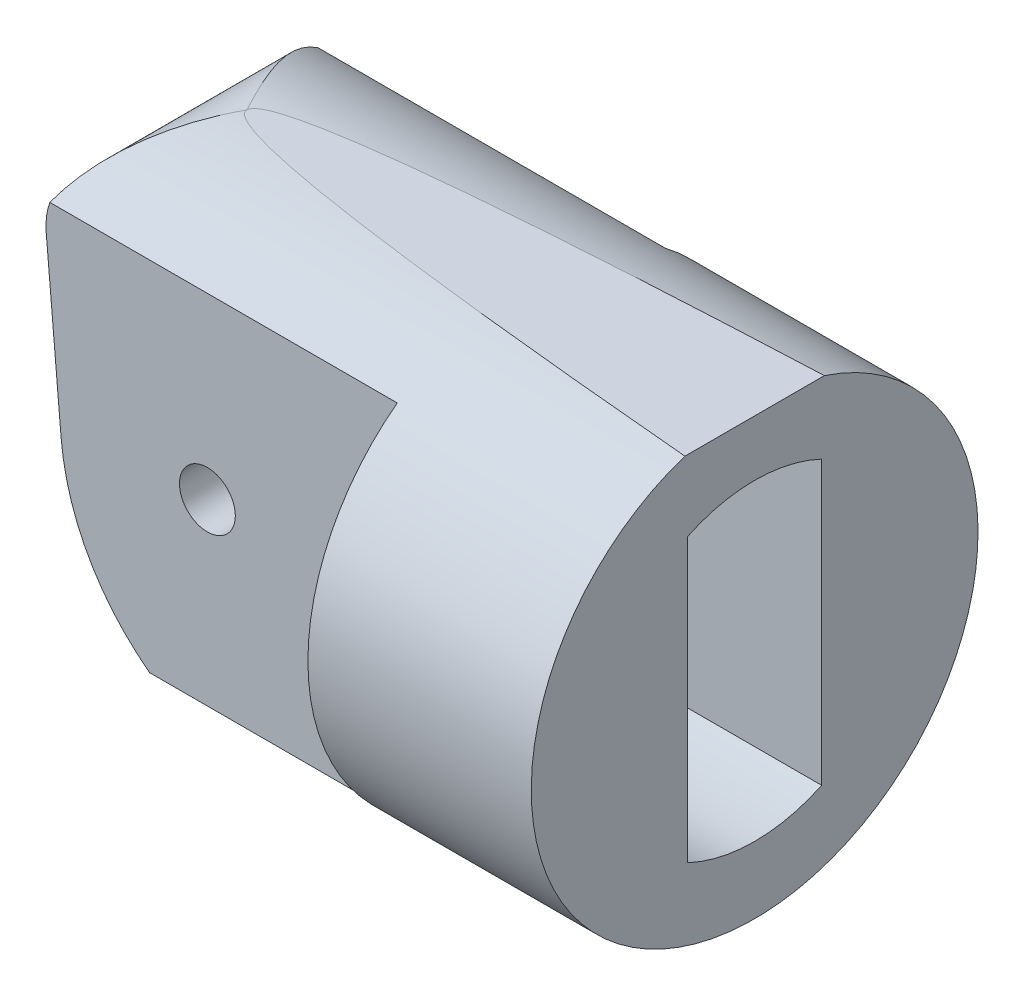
ISO-10303-21;
HEADER;
FILE_DESCRIPTION(('STEP AP214'),'2;1');
FILE_NAME('part.step','',(''),(''),'','','');
FILE_SCHEMA(('AUTOMOTIVE_DESIGN { 1 0 10303 214 1 1 1 1 }'));
ENDSEC;
DATA;
#1=APPLICATION_CONTEXT('core data for automotive mechanical design processes');
#2=APPLICATION_PROTOCOL_DEFINITION('international standard','automotive_design',2000,#1);
#3=PRODUCT_CONTEXT('',#1,'mechanical');
#4=PRODUCT('Part','Part','',(#3));
#5=PRODUCT_RELATED_PRODUCT_CATEGORY('part','',(#4));
#6=PRODUCT_DEFINITION_FORMATION('','',#4);
#7=PRODUCT_DEFINITION_CONTEXT('part definition',#1,'design');
#8=PRODUCT_DEFINITION('design','',#6,#7);
#9=PRODUCT_DEFINITION_SHAPE('','',#8);
#10=(LENGTH_UNIT() NAMED_UNIT(*) SI_UNIT(.MILLI.,.METRE.));
#11=(NAMED_UNIT(*) PLANE_ANGLE_UNIT() SI_UNIT($,.RADIAN.));
#12=(NAMED_UNIT(*) SI_UNIT($,.STERADIAN.) SOLID_ANGLE_UNIT());
#13=UNCERTAINTY_MEASURE_WITH_UNIT(LENGTH_MEASURE(1.E-05),#10,'distance_accuracy_value','');
#14=(GEOMETRIC_REPRESENTATION_CONTEXT(3) GLOBAL_UNCERTAINTY_ASSIGNED_CONTEXT((#13)) GLOBAL_UNIT_ASSIGNED_CONTEXT((#10,
#11,#12)) REPRESENTATION_CONTEXT('',''));
#15=CARTESIAN_POINT('',(0.,0.,0.));
#16=DIRECTION('',(0.,0.,1.));
#17=DIRECTION('',(1.,0.,0.));
#18=AXIS2_PLACEMENT_3D('',#15,#16,#17);
#19=CARTESIAN_POINT('',(-18.5,0.,-10.));
#20=DIRECTION('',(0.,0.,1.));
#21=DIRECTION('',(1.,0.,0.));
#22=AXIS2_PLACEMENT_3D('',#19,#20,#21);
#23=CYLINDRICAL_SURFACE('',#22,1.25);
#24=CARTESIAN_POINT('',(-18.5,0.,3.00000000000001));
#25=DIRECTION('',(0.,0.,1.));
#26=DIRECTION('',(1.,0.,0.));
#27=AXIS2_PLACEMENT_3D('',#24,#25,#26);
#28=CIRCLE('',#27,1.25);
#29=CARTESIAN_POINT('',(-17.25,0.,3.00000000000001));
#30=VERTEX_POINT('',#29);
#31=EDGE_CURVE('E319',#30,#30,#28,.F.);
#32=ORIENTED_EDGE('',*,*,#31,.T.);
#33=EDGE_LOOP('',(#32));
#34=FACE_BOUND('',#33,.T.);
#35=CARTESIAN_POINT('',(-18.5,0.,6.));
#36=DIRECTION('',(0.,0.,1.));
#37=DIRECTION('',(1.,0.,0.));
#38=AXIS2_PLACEMENT_3D('',#35,#36,#37);
#39=CIRCLE('',#38,1.25);
#40=CARTESIAN_POINT('',(-17.25,0.,6.));
#41=VERTEX_POINT('',#40);
#42=EDGE_CURVE('E176',#41,#41,#39,.T.);
#43=ORIENTED_EDGE('',*,*,#42,.T.);
#44=EDGE_LOOP('',(#43));
#45=FACE_BOUND('',#44,.T.);
#46=ADVANCED_FACE('F35',(#34,#45),#23,.F.);
#47=CARTESIAN_POINT('',(-25.7146585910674,6.73853277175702,-10.));
#48=DIRECTION('',(-0.996194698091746,-0.0871557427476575,0.));
#49=DIRECTION('',(0.0871557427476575,-0.996194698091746,0.));
#50=AXIS2_PLACEMENT_3D('',#47,#48,#49);
#51=PLANE('',#50);
#52=DIRECTION('',(-0.0871557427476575,0.996194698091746,0.));
#53=VECTOR('',#52,1.);
#54=CARTESIAN_POINT('',(-25.7146585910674,6.73853277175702,3.00000000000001));
#55=LINE('',#54,#53);
#56=CARTESIAN_POINT('',(-25.0488619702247,-0.871557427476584,3.00000000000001));
#57=VERTEX_POINT('',#56);
#58=CARTESIAN_POINT('',(-25.6784402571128,6.32455532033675,3.00000000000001));
#59=VERTEX_POINT('',#58);
#60=EDGE_CURVE('E314',#57,#59,#55,.T.);
#61=ORIENTED_EDGE('',*,*,#60,.F.);
#62=DIRECTION('',(0.,0.,1.));
#63=VECTOR('',#62,1.);
#64=CARTESIAN_POINT('',(-25.0488619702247,-0.871557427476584,-10.));
#65=LINE('',#64,#63);
#66=CARTESIAN_POINT('',(-25.0488619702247,-0.871557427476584,6.00000000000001));
#67=VERTEX_POINT('',#66);
#68=EDGE_CURVE('E292',#57,#67,#65,.T.);
#69=ORIENTED_EDGE('',*,*,#68,.T.);
#70=DIRECTION('',(0.0871557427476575,-0.996194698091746,0.));
#71=VECTOR('',#70,1.);
#72=CARTESIAN_POINT('',(-24.2635182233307,-9.84807753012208,6.00000000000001));
#73=LINE('',#72,#71);
#74=CARTESIAN_POINT('',(-25.7146585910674,6.73853277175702,6.));
#75=VERTEX_POINT('',#74);
#76=EDGE_CURVE('E272',#75,#67,#73,.T.);
#77=ORIENTED_EDGE('',*,*,#76,.F.);
#78=DIRECTION('',(0.,0.,1.));
#79=VECTOR('',#78,1.);
#80=CARTESIAN_POINT('',(-25.7146585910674,6.73853277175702,-10.));
#81=LINE('',#80,#79);
#82=CARTESIAN_POINT('',(-25.7146585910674,6.73853277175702,1.89530369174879));
#83=VERTEX_POINT('',#82);
#84=EDGE_CURVE('E305',#83,#75,#81,.T.);
#85=ORIENTED_EDGE('',*,*,#84,.F.);
#86=CARTESIAN_POINT('',(-25.1251133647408,0.,0.));
#87=DIRECTION('',(-0.996194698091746,-0.0871557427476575,0.));
#88=DIRECTION('',(0.0871557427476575,-0.996194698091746,0.));
#89=AXIS2_PLACEMENT_3D('',#86,#87,#88);
#90=ELLIPSE('',#89,7.02673886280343,7.);
#91=EDGE_CURVE('E330',#59,#83,#90,.T.);
#92=ORIENTED_EDGE('',*,*,#91,.F.);
#93=EDGE_LOOP('',(#61,#69,#77,#85,#92));
#94=FACE_BOUND('',#93,.T.);
#95=ADVANCED_FACE('F226',(#94),#51,.T.);
#96=CARTESIAN_POINT('',(-26.,0.,0.));
#97=DIRECTION('',(1.,0.,0.));
#98=DIRECTION('',(0.,0.,-1.));
#99=AXIS2_PLACEMENT_3D('',#96,#97,#98);
#100=CYLINDRICAL_SURFACE('',#99,10.);
#101=CARTESIAN_POINT('',(431.795415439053,0.,0.));
#102=DIRECTION('',(-0.0219958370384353,-0.999758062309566,0.));
#103=DIRECTION('',(0.999758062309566,-0.0219958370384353,0.));
#104=AXIS2_PLACEMENT_3D('',#101,#102,#103);
#105=ELLIPSE('',#104,454.631482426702,10.);
#106=CARTESIAN_POINT('',(0.,9.5,-3.1224989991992));
#107=VERTEX_POINT('',#106);
#108=CARTESIAN_POINT('',(-22.7260744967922,10.,0.));
#109=VERTEX_POINT('',#108);
#110=EDGE_CURVE('E288',#107,#109,#105,.F.);
#111=ORIENTED_EDGE('',*,*,#110,.F.);
#112=CARTESIAN_POINT('',(0.,0.,0.));
#113=DIRECTION('',(1.,0.,0.));
#114=DIRECTION('',(0.,0.,-1.));
#115=AXIS2_PLACEMENT_3D('',#112,#113,#114);
#116=CIRCLE('',#115,10.);
#117=CARTESIAN_POINT('',(0.,9.5,3.1224989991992));
#118=VERTEX_POINT('',#117);
#119=EDGE_CURVE('E155',#118,#107,#116,.T.);
#120=ORIENTED_EDGE('',*,*,#119,.F.);
#121=EDGE_CURVE('E62',#109,#118,#105,.F.);
#122=ORIENTED_EDGE('',*,*,#121,.F.);
#123=CARTESIAN_POINT('',(-25.7146585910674,6.73853277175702,7.38865184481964));
#124=CARTESIAN_POINT('',(-25.7228620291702,6.83244119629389,7.30302593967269));
#125=CARTESIAN_POINT('',(-25.7265024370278,6.92486557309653,7.21543631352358));
#126=CARTESIAN_POINT('',(-25.7255662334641,7.10618035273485,7.03692315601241));
#127=CARTESIAN_POINT('',(-25.7209998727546,7.19507502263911,6.94600392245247));
#128=CARTESIAN_POINT('',(-25.704634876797,7.36836828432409,6.76188138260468));
#129=CARTESIAN_POINT('',(-25.6928891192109,7.45279488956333,6.66869951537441));
#130=CARTESIAN_POINT('',(-25.6630049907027,7.61762260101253,6.47978011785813));
#131=CARTESIAN_POINT('',(-25.6448635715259,7.69802176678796,6.3840413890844));
#132=CARTESIAN_POINT('',(-25.5885092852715,7.90838990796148,6.12384452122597));
#133=CARTESIAN_POINT('',(-25.5450689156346,8.03447502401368,5.95735402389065));
#134=CARTESIAN_POINT('',(-25.4450872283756,8.27430751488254,5.61950272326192));
#135=CARTESIAN_POINT('',(-25.3885401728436,8.38804945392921,5.44813981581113));
#136=CARTESIAN_POINT('',(-25.2644421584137,8.60382839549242,5.10060837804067));
#137=CARTESIAN_POINT('',(-25.1968298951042,8.70579445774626,4.92441790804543));
#138=CARTESIAN_POINT('',(-25.0528769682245,8.89745941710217,4.56902472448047));
#139=CARTESIAN_POINT('',(-24.9765366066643,8.98715873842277,4.38982211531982));
#140=CARTESIAN_POINT('',(-24.7801296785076,9.19302787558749,3.94619285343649));
#141=CARTESIAN_POINT('',(-24.656072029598,9.30245864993,3.68039025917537));
#142=CARTESIAN_POINT('',(-24.3970450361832,9.49681514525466,3.14509908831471));
#143=CARTESIAN_POINT('',(-24.2620698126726,9.58172754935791,2.87560859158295));
#144=CARTESIAN_POINT('',(-23.9847699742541,9.72767010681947,2.33468530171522));
#145=CARTESIAN_POINT('',(-23.8424597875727,9.7887452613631,2.06325716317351));
#146=CARTESIAN_POINT('',(-23.553003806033,9.88783190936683,1.51896433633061));
#147=CARTESIAN_POINT('',(-23.4058606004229,9.92585554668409,1.24610048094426));
#148=CARTESIAN_POINT('',(-23.1710462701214,9.96811507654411,0.813775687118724));
#149=CARTESIAN_POINT('',(-23.0842045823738,9.97982994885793,0.654550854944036));
#150=CARTESIAN_POINT('',(-22.9101344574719,9.99562233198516,0.33605814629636));
#151=CARTESIAN_POINT('',(-22.8229063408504,9.99970529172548,0.176790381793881));
#152=CARTESIAN_POINT('',(-22.7324796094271,9.9999948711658,0.0116940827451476));
#153=CARTESIAN_POINT('',(-22.7292770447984,9.99999999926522,0.00584702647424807));
#154=CARTESIAN_POINT('',(-22.7260744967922,10.,0.));
#155=B_SPLINE_CURVE_WITH_KNOTS('',3,(#123,#124,#125,#126,#127,#128,#129,#130,#131,#132,#133,
#134,#135,#136,#137,#138,#139,#140,#141,#142,#143,#144,#145,#146,#147,#148,#149,#150,#151,#152,
#153,#154),.UNSPECIFIED.,.F.,.F.,(4,2,2,2,2,2,2,2,2,2,2,2,2,2,2,4),(0.,0.38184447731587,
0.763212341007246,1.14180464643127,1.52057763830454,2.1595204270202,2.79874346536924,
3.44163595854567,4.08450621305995,5.02235097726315,5.96070416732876,6.89727721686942,
7.83335643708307,8.37845947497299,8.92317317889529,8.94317318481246),.UNSPECIFIED.);
#156=CARTESIAN_POINT('',(-25.5545016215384,7.99999999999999,6.00000000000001));
#157=VERTEX_POINT('',#156);
#158=EDGE_CURVE('E144',#109,#157,#155,.F.);
#159=ORIENTED_EDGE('',*,*,#158,.T.);
#160=DIRECTION('',(1.,0.,0.));
#161=VECTOR('',#160,1.);
#162=CARTESIAN_POINT('',(-26.,7.99999999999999,6.00000000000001));
#163=LINE('',#162,#161);
#164=CARTESIAN_POINT('',(-10.,8.,6.));
#165=VERTEX_POINT('',#164);
#166=EDGE_CURVE('E137',#157,#165,#163,.T.);
#167=ORIENTED_EDGE('',*,*,#166,.T.);
#168=CARTESIAN_POINT('',(-9.99999999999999,0.,0.));
#169=DIRECTION('',(1.,0.,0.));
#170=DIRECTION('',(0.,0.,-1.));
#171=AXIS2_PLACEMENT_3D('',#168,#169,#170);
#172=CIRCLE('',#171,10.);
#173=CARTESIAN_POINT('',(-10.,-8.,6.));
#174=VERTEX_POINT('',#173);
#175=EDGE_CURVE('E141',#174,#165,#172,.F.);
#176=ORIENTED_EDGE('',*,*,#175,.F.);
#177=DIRECTION('',(1.,0.,0.));
#178=VECTOR('',#177,1.);
#179=CARTESIAN_POINT('',(-26.,-7.99999999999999,6.00000000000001));
#180=LINE('',#179,#178);
#181=CARTESIAN_POINT('',(-21.0869149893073,-7.99999999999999,6.00000000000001));
#182=VERTEX_POINT('',#181);
#183=EDGE_CURVE('E148',#174,#182,#180,.F.);
#184=ORIENTED_EDGE('',*,*,#183,.T.);
#185=CARTESIAN_POINT('',(-15.0869149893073,0.,0.));
#186=DIRECTION('',(0.707106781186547,0.,0.707106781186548));
#187=DIRECTION('',(0.707106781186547,0.,-0.707106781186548));
#188=AXIS2_PLACEMENT_3D('',#185,#186,#187);
#189=ELLIPSE('',#188,14.142135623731,10.);
#190=CARTESIAN_POINT('',(-15.0869149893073,-10.,0.));
#191=VERTEX_POINT('',#190);
#192=EDGE_CURVE('E271',#182,#191,#189,.T.);
#193=ORIENTED_EDGE('',*,*,#192,.T.);
#194=CARTESIAN_POINT('',(-15.0869149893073,0.,0.));
#195=DIRECTION('',(0.707106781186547,0.,-0.707106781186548));
#196=DIRECTION('',(0.707106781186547,0.,0.707106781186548));
#197=AXIS2_PLACEMENT_3D('',#194,#195,#196);
#198=ELLIPSE('',#197,14.142135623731,10.);
#199=CARTESIAN_POINT('',(-21.0869149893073,-7.99999999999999,-6.));
#200=VERTEX_POINT('',#199);
#201=EDGE_CURVE('E266',#191,#200,#198,.T.);
#202=ORIENTED_EDGE('',*,*,#201,.T.);
#203=DIRECTION('',(1.,0.,0.));
#204=VECTOR('',#203,1.);
#205=CARTESIAN_POINT('',(-26.,-8.,-6.));
#206=LINE('',#205,#204);
#207=CARTESIAN_POINT('',(-9.99999999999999,-8.,-6.));
#208=VERTEX_POINT('',#207);
#209=EDGE_CURVE('E160',#208,#200,#206,.F.);
#210=ORIENTED_EDGE('',*,*,#209,.F.);
#211=CARTESIAN_POINT('',(-9.99999999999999,0.,0.));
#212=DIRECTION('',(-1.,0.,0.));
#213=DIRECTION('',(0.,0.,1.));
#214=AXIS2_PLACEMENT_3D('',#211,#212,#213);
#215=CIRCLE('',#214,10.);
#216=CARTESIAN_POINT('',(-9.99999999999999,8.,-6.));
#217=VERTEX_POINT('',#216);
#218=EDGE_CURVE('E154',#208,#217,#215,.F.);
#219=ORIENTED_EDGE('',*,*,#218,.T.);
#220=DIRECTION('',(1.,0.,0.));
#221=VECTOR('',#220,1.);
#222=CARTESIAN_POINT('',(-26.,8.,-6.));
#223=LINE('',#222,#221);
#224=CARTESIAN_POINT('',(-25.5545016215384,8.,-6.));
#225=VERTEX_POINT('',#224);
#226=EDGE_CURVE('E163',#225,#217,#223,.T.);
#227=ORIENTED_EDGE('',*,*,#226,.F.);
#228=CARTESIAN_POINT('',(-25.7146585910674,6.73853277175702,-7.38865184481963));
#229=CARTESIAN_POINT('',(-25.7228620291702,6.8324411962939,-7.30302593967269));
#230=CARTESIAN_POINT('',(-25.7265024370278,6.92486557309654,-7.21543631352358));
#231=CARTESIAN_POINT('',(-25.7255662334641,7.10618035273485,-7.03692315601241));
#232=CARTESIAN_POINT('',(-25.7209998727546,7.19507502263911,-6.94600392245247));
#233=CARTESIAN_POINT('',(-25.704634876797,7.36836828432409,-6.76188138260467));
#234=CARTESIAN_POINT('',(-25.6928891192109,7.45279488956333,-6.66869951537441));
#235=CARTESIAN_POINT('',(-25.6630049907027,7.61762260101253,-6.47978011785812));
#236=CARTESIAN_POINT('',(-25.6448635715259,7.69802176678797,-6.3840413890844));
#237=CARTESIAN_POINT('',(-25.5885092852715,7.90838990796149,-6.12384452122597));
#238=CARTESIAN_POINT('',(-25.5450689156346,8.03447502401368,-5.95735402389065));
#239=CARTESIAN_POINT('',(-25.4450872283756,8.27430751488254,-5.61950272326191));
#240=CARTESIAN_POINT('',(-25.3885401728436,8.38804945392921,-5.44813981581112));
#241=CARTESIAN_POINT('',(-25.2644421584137,8.60382839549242,-5.10060837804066));
#242=CARTESIAN_POINT('',(-25.1968298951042,8.70579445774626,-4.92441790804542));
#243=CARTESIAN_POINT('',(-25.0528769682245,8.89745941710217,-4.56902472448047));
#244=CARTESIAN_POINT('',(-24.9765366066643,8.98715873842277,-4.38982211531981));
#245=CARTESIAN_POINT('',(-24.7801296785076,9.19302787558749,-3.94619285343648));
#246=CARTESIAN_POINT('',(-24.656072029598,9.30245864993,-3.68039025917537));
#247=CARTESIAN_POINT('',(-24.3970450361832,9.49681514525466,-3.14509908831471));
#248=CARTESIAN_POINT('',(-24.2620698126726,9.58172754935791,-2.87560859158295));
#249=CARTESIAN_POINT('',(-23.9847699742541,9.72767010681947,-2.33468530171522));
#250=CARTESIAN_POINT('',(-23.8424597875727,9.7887452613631,-2.06325716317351));
#251=CARTESIAN_POINT('',(-23.553003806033,9.88783190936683,-1.51896433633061));
#252=CARTESIAN_POINT('',(-23.4058606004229,9.92585554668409,-1.24610048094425));
#253=CARTESIAN_POINT('',(-23.1710462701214,9.96811507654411,-0.813775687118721));
#254=CARTESIAN_POINT('',(-23.0842045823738,9.97982994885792,-0.654550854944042));
#255=CARTESIAN_POINT('',(-22.9101344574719,9.99562233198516,-0.336058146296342));
#256=CARTESIAN_POINT('',(-22.8229063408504,9.99970529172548,-0.17679038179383));
#257=CARTESIAN_POINT('',(-22.7324796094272,9.9999948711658,-0.0116940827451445));
#258=CARTESIAN_POINT('',(-22.7292770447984,9.99999999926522,-0.00584702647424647));
#259=CARTESIAN_POINT('',(-22.7260744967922,10.,0.));
#260=B_SPLINE_CURVE_WITH_KNOTS('',3,(#228,#229,#230,#231,#232,#233,#234,#235,#236,#237,#238,
#239,#240,#241,#242,#243,#244,#245,#246,#247,#248,#249,#250,#251,#252,#253,#254,#255,#256,#257,
#258,#259),.UNSPECIFIED.,.F.,.F.,(4,2,2,2,2,2,2,2,2,2,2,2,2,2,2,4),(0.,0.381844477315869,
0.763212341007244,1.14180464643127,1.52057763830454,2.15952042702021,2.79874346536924,
3.44163595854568,4.08450621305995,5.02235097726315,5.96070416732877,6.89727721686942,
7.83335643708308,8.37845947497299,8.92317317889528,8.94317318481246),.UNSPECIFIED.);
#261=EDGE_CURVE('E286',#225,#109,#260,.T.);
#262=ORIENTED_EDGE('',*,*,#261,.T.);
#263=EDGE_LOOP('',(#111,#120,#122,#159,#167,#176,#184,#193,#202,#210,#219,#227,#262));
#264=FACE_BOUND('',#263,.T.);
#265=ADVANCED_FACE('F37',(#264),#100,.T.);
#266=CARTESIAN_POINT('',(-26.,-10.,6.00000000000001));
#267=DIRECTION('',(0.,0.,1.));
#268=DIRECTION('',(1.,0.,0.));
#269=AXIS2_PLACEMENT_3D('',#266,#267,#268);
#270=PLANE('',#269);
#271=ORIENTED_EDGE('',*,*,#42,.F.);
#272=EDGE_LOOP('',(#271));
#273=FACE_BOUND('',#272,.T.);
#274=ORIENTED_EDGE('',*,*,#76,.T.);
#275=CARTESIAN_POINT('',(-15.0869149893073,0.,6.));
#276=DIRECTION('',(0.,0.,1.));
#277=DIRECTION('',(1.,0.,0.));
#278=AXIS2_PLACEMENT_3D('',#275,#276,#277);
#279=CIRCLE('',#278,10.);
#280=EDGE_CURVE('E177',#67,#182,#279,.T.);
#281=ORIENTED_EDGE('',*,*,#280,.T.);
#282=ORIENTED_EDGE('',*,*,#183,.F.);
#283=DIRECTION('',(0.,1.,0.));
#284=VECTOR('',#283,1.);
#285=CARTESIAN_POINT('',(-9.99999999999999,-10.,6.));
#286=LINE('',#285,#284);
#287=EDGE_CURVE('E149',#174,#165,#286,.T.);
#288=ORIENTED_EDGE('',*,*,#287,.T.);
#289=ORIENTED_EDGE('',*,*,#166,.F.);
#290=CARTESIAN_POINT('',(-22.7260744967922,7.,6.));
#291=DIRECTION('',(0.,0.,1.));
#292=DIRECTION('',(1.,0.,0.));
#293=AXIS2_PLACEMENT_3D('',#290,#291,#292);
#294=CIRCLE('',#293,3.);
#295=EDGE_CURVE('E275',#157,#75,#294,.T.);
#296=ORIENTED_EDGE('',*,*,#295,.T.);
#297=EDGE_LOOP('',(#274,#281,#282,#288,#289,#296));
#298=FACE_BOUND('',#297,.T.);
#299=ADVANCED_FACE('F158',(#273,#298),#270,.T.);
#300=CARTESIAN_POINT('',(-26.,-10.,-6.));
#301=DIRECTION('',(0.,0.,1.));
#302=DIRECTION('',(1.,0.,0.));
#303=AXIS2_PLACEMENT_3D('',#300,#301,#302);
#304=PLANE('',#303);
#305=CARTESIAN_POINT('',(-18.5,0.,-6.));
#306=DIRECTION('',(0.,0.,1.));
#307=DIRECTION('',(1.,0.,0.));
#308=AXIS2_PLACEMENT_3D('',#305,#306,#307);
#309=CIRCLE('',#308,1.25);
#310=CARTESIAN_POINT('',(-17.25,0.,-6.));
#311=VERTEX_POINT('',#310);
#312=EDGE_CURVE('E173',#311,#311,#309,.T.);
#313=ORIENTED_EDGE('',*,*,#312,.T.);
#314=EDGE_LOOP('',(#313));
#315=FACE_BOUND('',#314,.T.);
#316=CARTESIAN_POINT('',(-15.0869149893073,0.,-6.));
#317=DIRECTION('',(0.,0.,1.));
#318=DIRECTION('',(1.,0.,0.));
#319=AXIS2_PLACEMENT_3D('',#316,#317,#318);
#320=CIRCLE('',#319,10.);
#321=CARTESIAN_POINT('',(-25.0488619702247,-0.871557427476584,-6.));
#322=VERTEX_POINT('',#321);
#323=EDGE_CURVE('E181',#322,#200,#320,.T.);
#324=ORIENTED_EDGE('',*,*,#323,.F.);
#325=DIRECTION('',(0.0871557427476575,-0.996194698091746,0.));
#326=VECTOR('',#325,1.);
#327=CARTESIAN_POINT('',(-24.2635182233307,-9.84807753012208,-6.));
#328=LINE('',#327,#326);
#329=CARTESIAN_POINT('',(-25.7146585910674,6.73853277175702,-6.));
#330=VERTEX_POINT('',#329);
#331=EDGE_CURVE('E179',#330,#322,#328,.T.);
#332=ORIENTED_EDGE('',*,*,#331,.F.);
#333=CARTESIAN_POINT('',(-22.7260744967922,7.,-6.));
#334=DIRECTION('',(0.,0.,1.));
#335=DIRECTION('',(1.,0.,0.));
#336=AXIS2_PLACEMENT_3D('',#333,#334,#335);
#337=CIRCLE('',#336,3.);
#338=EDGE_CURVE('E172',#225,#330,#337,.T.);
#339=ORIENTED_EDGE('',*,*,#338,.F.);
#340=ORIENTED_EDGE('',*,*,#226,.T.);
#341=DIRECTION('',(0.,1.,0.));
#342=VECTOR('',#341,1.);
#343=CARTESIAN_POINT('',(-9.99999999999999,-10.,-6.));
#344=LINE('',#343,#342);
#345=EDGE_CURVE('E282',#208,#217,#344,.T.);
#346=ORIENTED_EDGE('',*,*,#345,.F.);
#347=ORIENTED_EDGE('',*,*,#209,.T.);
#348=EDGE_LOOP('',(#324,#332,#339,#340,#346,#347));
#349=FACE_BOUND('',#348,.T.);
#350=ADVANCED_FACE('F253',(#315,#349),#304,.F.);
#351=CARTESIAN_POINT('',(0.,0.,0.));
#352=DIRECTION('',(1.,0.,0.));
#353=DIRECTION('',(0.,0.,-1.));
#354=AXIS2_PLACEMENT_3D('',#351,#352,#353);
#355=PLANE('',#354);
#356=CARTESIAN_POINT('',(0.,0.,0.));
#357=DIRECTION('',(1.,0.,0.));
#358=DIRECTION('',(0.,0.,-1.));
#359=AXIS2_PLACEMENT_3D('',#356,#357,#358);
#360=CIRCLE('',#359,7.);
#361=CARTESIAN_POINT('',(0.,-6.32455532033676,3.00000000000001));
#362=VERTEX_POINT('',#361);
#363=CARTESIAN_POINT('',(0.,-6.32455532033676,-3.));
#364=VERTEX_POINT('',#363);
#365=EDGE_CURVE('E40',#362,#364,#360,.T.);
#366=ORIENTED_EDGE('',*,*,#365,.F.);
#367=DIRECTION('',(0.,1.,0.));
#368=VECTOR('',#367,1.);
#369=CARTESIAN_POINT('',(0.,-6.32455532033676,3.00000000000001));
#370=LINE('',#369,#368);
#371=CARTESIAN_POINT('',(0.,6.32455532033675,3.00000000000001));
#372=VERTEX_POINT('',#371);
#373=EDGE_CURVE('E84',#372,#362,#370,.F.);
#374=ORIENTED_EDGE('',*,*,#373,.F.);
#375=CARTESIAN_POINT('',(0.,0.,0.));
#376=DIRECTION('',(1.,0.,0.));
#377=DIRECTION('',(0.,0.,-1.));
#378=AXIS2_PLACEMENT_3D('',#375,#376,#377);
#379=CIRCLE('',#378,7.);
#380=CARTESIAN_POINT('',(0.,6.32455532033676,-3.));
#381=VERTEX_POINT('',#380);
#382=EDGE_CURVE('E326',#381,#372,#379,.T.);
#383=ORIENTED_EDGE('',*,*,#382,.F.);
#384=DIRECTION('',(0.,1.,0.));
#385=VECTOR('',#384,1.);
#386=CARTESIAN_POINT('',(0.,-6.32455532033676,-3.));
#387=LINE('',#386,#385);
#388=EDGE_CURVE('E322',#364,#381,#387,.T.);
#389=ORIENTED_EDGE('',*,*,#388,.F.);
#390=EDGE_LOOP('',(#366,#374,#383,#389));
#391=FACE_BOUND('',#390,.T.);
#392=DIRECTION('',(0.,0.,1.));
#393=VECTOR('',#392,1.);
#394=CARTESIAN_POINT('',(0.,9.5,-10.));
#395=LINE('',#394,#393);
#396=EDGE_CURVE('E317',#107,#118,#395,.T.);
#397=ORIENTED_EDGE('',*,*,#396,.T.);
#398=ORIENTED_EDGE('',*,*,#119,.T.);
#399=EDGE_LOOP('',(#397,#398));
#400=FACE_BOUND('',#399,.T.);
#401=ADVANCED_FACE('F256',(#391,#400),#355,.T.);
#402=CARTESIAN_POINT('',(-10.,-10.,10.));
#403=DIRECTION('',(1.,0.,0.));
#404=DIRECTION('',(0.,0.,-1.));
#405=AXIS2_PLACEMENT_3D('',#402,#403,#404);
#406=PLANE('',#405);
#407=ORIENTED_EDGE('',*,*,#287,.F.);
#408=ORIENTED_EDGE('',*,*,#175,.T.);
#409=EDGE_LOOP('',(#407,#408));
#410=FACE_BOUND('',#409,.T.);
#411=ADVANCED_FACE('F153',(#410),#406,.F.);
#412=CARTESIAN_POINT('',(-10.,-10.,-10.));
#413=DIRECTION('',(-1.,0.,0.));
#414=DIRECTION('',(0.,0.,1.));
#415=AXIS2_PLACEMENT_3D('',#412,#413,#414);
#416=PLANE('',#415);
#417=ORIENTED_EDGE('',*,*,#345,.T.);
#418=ORIENTED_EDGE('',*,*,#218,.F.);
#419=EDGE_LOOP('',(#417,#418));
#420=FACE_BOUND('',#419,.T.);
#421=ADVANCED_FACE('F238',(#420),#416,.T.);
#422=CARTESIAN_POINT('',(-18.5,0.,-3.));
#423=DIRECTION('',(0.,0.,-1.));
#424=DIRECTION('',(-1.,0.,0.));
#425=AXIS2_PLACEMENT_3D('',#422,#423,#424);
#426=CIRCLE('',#425,1.25);
#427=CARTESIAN_POINT('',(-19.75,0.,-3.));
#428=VERTEX_POINT('',#427);
#429=EDGE_CURVE('E250',#428,#428,#426,.F.);
#430=ORIENTED_EDGE('',*,*,#429,.T.);
#431=EDGE_LOOP('',(#430));
#432=FACE_BOUND('',#431,.T.);
#433=ORIENTED_EDGE('',*,*,#312,.F.);
#434=EDGE_LOOP('',(#433));
#435=FACE_BOUND('',#434,.T.);
#436=ADVANCED_FACE('F228',(#432,#435),#23,.F.);
#437=CARTESIAN_POINT('',(-25.7146585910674,6.73853277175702,-1.89530369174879));
#438=VERTEX_POINT('',#437);
#439=CARTESIAN_POINT('',(-25.6784402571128,6.32455532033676,-3.));
#440=VERTEX_POINT('',#439);
#441=EDGE_CURVE('E327',#438,#440,#90,.T.);
#442=ORIENTED_EDGE('',*,*,#441,.F.);
#443=EDGE_CURVE('E298',#330,#438,#81,.T.);
#444=ORIENTED_EDGE('',*,*,#443,.F.);
#445=ORIENTED_EDGE('',*,*,#331,.T.);
#446=CARTESIAN_POINT('',(-25.0488619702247,-0.871557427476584,-3.));
#447=VERTEX_POINT('',#446);
#448=EDGE_CURVE('E270',#322,#447,#65,.T.);
#449=ORIENTED_EDGE('',*,*,#448,.T.);
#450=DIRECTION('',(0.0871557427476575,-0.996194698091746,0.));
#451=VECTOR('',#450,1.);
#452=CARTESIAN_POINT('',(-25.7146585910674,6.73853277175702,-3.));
#453=LINE('',#452,#451);
#454=EDGE_CURVE('E324',#440,#447,#453,.T.);
#455=ORIENTED_EDGE('',*,*,#454,.F.);
#456=EDGE_LOOP('',(#442,#444,#445,#449,#455));
#457=FACE_BOUND('',#456,.T.);
#458=ADVANCED_FACE('F215',(#457),#51,.T.);
#459=CARTESIAN_POINT('',(-15.0869149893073,0.,-10.));
#460=DIRECTION('',(0.,0.,1.));
#461=DIRECTION('',(1.,0.,0.));
#462=AXIS2_PLACEMENT_3D('',#459,#460,#461);
#463=CYLINDRICAL_SURFACE('',#462,10.);
#464=CARTESIAN_POINT('',(-15.0869149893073,0.,3.00000000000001));
#465=DIRECTION('',(0.,0.,1.));
#466=DIRECTION('',(1.,0.,0.));
#467=AXIS2_PLACEMENT_3D('',#464,#465,#466);
#468=CIRCLE('',#467,10.);
#469=CARTESIAN_POINT('',(-22.8328816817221,-6.32455532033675,3.00000000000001));
#470=VERTEX_POINT('',#469);
#471=EDGE_CURVE('E12',#470,#57,#468,.F.);
#472=ORIENTED_EDGE('',*,*,#471,.F.);
#473=CARTESIAN_POINT('',(-22.8328816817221,-6.32455532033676,-3.));
#474=CARTESIAN_POINT('',(-22.7805431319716,-6.38866113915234,-2.8648505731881));
#475=CARTESIAN_POINT('',(-22.7301463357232,-6.44875420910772,-2.72697675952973));
#476=CARTESIAN_POINT('',(-22.634440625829,-6.56050796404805,-2.44594289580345));
#477=CARTESIAN_POINT('',(-22.5891377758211,-6.6121586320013,-2.30277680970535));
#478=CARTESIAN_POINT('',(-22.5047116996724,-6.70673841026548,-2.01080432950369));
#479=CARTESIAN_POINT('',(-22.4656254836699,-6.74961569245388,-1.86197024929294));
#480=CARTESIAN_POINT('',(-22.3952827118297,-6.82571978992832,-1.56005642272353));
#481=CARTESIAN_POINT('',(-22.3640244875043,-6.85894866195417,-1.406977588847));
#482=CARTESIAN_POINT('',(-22.3103483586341,-6.91545719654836,-1.09616935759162));
#483=CARTESIAN_POINT('',(-22.2880015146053,-6.93865700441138,-0.938412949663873));
#484=CARTESIAN_POINT('',(-22.2535138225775,-6.97427286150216,-0.620555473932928));
#485=CARTESIAN_POINT('',(-22.2413735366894,-6.98668831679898,-0.46045427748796));
#486=CARTESIAN_POINT('',(-22.2279264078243,-7.00043213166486,-0.139930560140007));
#487=CARTESIAN_POINT('',(-22.2265783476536,-7.00180267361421,0.0204883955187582));
#488=CARTESIAN_POINT('',(-22.2346759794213,-6.99353603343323,0.340751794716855));
#489=CARTESIAN_POINT('',(-22.2441206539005,-6.98389988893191,0.500596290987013));
#490=CARTESIAN_POINT('',(-22.2717797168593,-6.95543381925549,0.801425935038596));
#491=CARTESIAN_POINT('',(-22.2889567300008,-6.9376884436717,0.942611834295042));
#492=CARTESIAN_POINT('',(-22.3309094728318,-6.89387102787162,1.22255850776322));
#493=CARTESIAN_POINT('',(-22.3556882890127,-6.86779560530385,1.36131827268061));
#494=CARTESIAN_POINT('',(-22.4403165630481,-6.77748725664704,1.77331846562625));
#495=CARTESIAN_POINT('',(-22.5104263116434,-6.70120271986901,2.04196892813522));
#496=CARTESIAN_POINT('',(-22.6271196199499,-6.5687440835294,2.42236953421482));
#497=CARTESIAN_POINT('',(-22.6660502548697,-6.5238511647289,2.54072906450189));
#498=CARTESIAN_POINT('',(-22.7471715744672,-6.42840485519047,2.77331505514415));
#499=CARTESIAN_POINT('',(-22.789346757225,-6.37787791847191,2.88755775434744));
#500=CARTESIAN_POINT('',(-22.8328816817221,-6.32455532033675,3.00000000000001));
#501=B_SPLINE_CURVE_WITH_KNOTS('',3,(#473,#474,#475,#476,#477,#478,#479,#480,#481,#482,#483,
#484,#485,#486,#487,#488,#489,#490,#491,#492,#493,#494,#495,#496,#497,#498,#499,#500),
.UNSPECIFIED.,.F.,.F.,(4,2,2,2,2,2,2,2,2,2,2,2,2,4),(0.,0.475426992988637,0.95141405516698,
1.43013658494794,1.90875699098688,2.39112111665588,2.87351180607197,3.3540592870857,
3.83456146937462,4.26405614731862,4.69372544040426,5.55399585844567,5.95115640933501,
6.34652496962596),.UNSPECIFIED.);
#502=CARTESIAN_POINT('',(-22.8328816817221,-6.32455532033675,-3.));
#503=VERTEX_POINT('',#502);
#504=EDGE_CURVE('E45',#503,#470,#501,.T.);
#505=ORIENTED_EDGE('',*,*,#504,.F.);
#506=CARTESIAN_POINT('',(-15.0869149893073,0.,-3.));
#507=DIRECTION('',(0.,0.,-1.));
#508=DIRECTION('',(-1.,0.,0.));
#509=AXIS2_PLACEMENT_3D('',#506,#507,#508);
#510=CIRCLE('',#509,10.);
#511=EDGE_CURVE('E191',#447,#503,#510,.F.);
#512=ORIENTED_EDGE('',*,*,#511,.F.);
#513=ORIENTED_EDGE('',*,*,#448,.F.);
#514=ORIENTED_EDGE('',*,*,#323,.T.);
#515=ORIENTED_EDGE('',*,*,#201,.F.);
#516=ORIENTED_EDGE('',*,*,#192,.F.);
#517=ORIENTED_EDGE('',*,*,#280,.F.);
#518=ORIENTED_EDGE('',*,*,#68,.F.);
#519=EDGE_LOOP('',(#472,#505,#512,#513,#514,#515,#516,#517,#518));
#520=FACE_BOUND('',#519,.T.);
#521=ADVANCED_FACE('F212',(#520),#463,.T.);
#522=CARTESIAN_POINT('',(-22.7260744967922,7.,-10.));
#523=DIRECTION('',(0.,0.,1.));
#524=DIRECTION('',(1.,0.,0.));
#525=AXIS2_PLACEMENT_3D('',#522,#523,#524);
#526=CYLINDRICAL_SURFACE('',#525,3.);
#527=CARTESIAN_POINT('',(-25.7146585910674,6.73853277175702,1.89530369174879));
#528=CARTESIAN_POINT('',(-25.7169910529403,6.76529250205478,1.8001680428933));
#529=CARTESIAN_POINT('',(-25.7188022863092,6.79003712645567,1.7044562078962));
#530=CARTESIAN_POINT('',(-25.7216472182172,6.83545387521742,1.51206286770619));
#531=CARTESIAN_POINT('',(-25.72268094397,6.85612614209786,1.41538139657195));
#532=CARTESIAN_POINT('',(-25.7242360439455,6.89336099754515,1.22120795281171));
#533=CARTESIAN_POINT('',(-25.724757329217,6.90992287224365,1.1237158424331));
#534=CARTESIAN_POINT('',(-25.7254868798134,6.93890243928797,0.928121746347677));
#535=CARTESIAN_POINT('',(-25.7256951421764,6.95132009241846,0.830019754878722));
#536=CARTESIAN_POINT('',(-25.7260919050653,6.98185522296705,0.539476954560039));
#537=CARTESIAN_POINT('',(-25.7260717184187,6.994096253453,0.346386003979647));
#538=CARTESIAN_POINT('',(-25.7260763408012,7.00255248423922,-0.0400787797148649));
#539=CARTESIAN_POINT('',(-25.7261011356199,6.99877274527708,-0.233452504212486));
#540=CARTESIAN_POINT('',(-25.7260113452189,6.97948570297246,-0.549581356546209));
#541=CARTESIAN_POINT('',(-25.7259438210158,6.96870178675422,-0.672642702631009));
#542=CARTESIAN_POINT('',(-25.7255202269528,6.94064018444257,-0.918019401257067));
#543=CARTESIAN_POINT('',(-25.7251641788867,6.92336298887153,-1.04033480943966));
#544=CARTESIAN_POINT('',(-25.7238290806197,6.88206263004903,-1.28565457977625));
#545=CARTESIAN_POINT('',(-25.7228410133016,6.85794468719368,-1.40864294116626));
#546=CARTESIAN_POINT('',(-25.7197285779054,6.80314375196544,-1.65316415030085));
#547=CARTESIAN_POINT('',(-25.7176039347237,6.772459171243,-1.77469663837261));
#548=CARTESIAN_POINT('',(-25.7146585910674,6.73853277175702,-1.89530369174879));
#549=B_SPLINE_CURVE_WITH_KNOTS('',3,(#527,#528,#529,#530,#531,#532,#533,#534,#535,#536,#537,
#538,#539,#540,#541,#542,#543,#544,#545,#546,#547,#548),.UNSPECIFIED.,.F.,.F.,(4,2,2,2,2,2,2,2,
2,2,4),(0.,0.296536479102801,0.593062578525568,0.889640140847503,1.18622050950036,
1.76594571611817,2.34548780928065,2.71592918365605,3.08634257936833,3.4621623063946,
3.8380730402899),.UNSPECIFIED.);
#550=EDGE_CURVE('E183',#83,#438,#549,.T.);
#551=ORIENTED_EDGE('',*,*,#550,.F.);
#552=ORIENTED_EDGE('',*,*,#84,.T.);
#553=ORIENTED_EDGE('',*,*,#295,.F.);
#554=ORIENTED_EDGE('',*,*,#158,.F.);
#555=ORIENTED_EDGE('',*,*,#261,.F.);
#556=ORIENTED_EDGE('',*,*,#338,.T.);
#557=ORIENTED_EDGE('',*,*,#443,.T.);
#558=EDGE_LOOP('',(#551,#552,#553,#554,#555,#556,#557));
#559=FACE_BOUND('',#558,.T.);
#560=ADVANCED_FACE('F193',(#559),#526,.T.);
#561=CARTESIAN_POINT('',(-22.7260744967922,10.,-10.));
#562=DIRECTION('',(-0.0219958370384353,-0.999758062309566,0.));
#563=DIRECTION('',(0.999758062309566,-0.0219958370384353,0.));
#564=AXIS2_PLACEMENT_3D('',#561,#562,#563);
#565=PLANE('',#564);
#566=ORIENTED_EDGE('',*,*,#110,.T.);
#567=ORIENTED_EDGE('',*,*,#121,.T.);
#568=ORIENTED_EDGE('',*,*,#396,.F.);
#569=EDGE_LOOP('',(#566,#567,#568));
#570=FACE_BOUND('',#569,.T.);
#571=ADVANCED_FACE('F209',(#570),#565,.F.);
#572=CARTESIAN_POINT('',(-25.7260744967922,-6.32455532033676,3.00000000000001));
#573=DIRECTION('',(0.,0.,1.));
#574=DIRECTION('',(1.,0.,0.));
#575=AXIS2_PLACEMENT_3D('',#572,#573,#574);
#576=PLANE('',#575);
#577=ORIENTED_EDGE('',*,*,#373,.T.);
#578=DIRECTION('',(1.,0.,0.));
#579=VECTOR('',#578,1.);
#580=CARTESIAN_POINT('',(-25.7260744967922,-6.32455532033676,3.00000000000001));
#581=LINE('',#580,#579);
#582=EDGE_CURVE('E331',#470,#362,#581,.T.);
#583=ORIENTED_EDGE('',*,*,#582,.F.);
#584=ORIENTED_EDGE('',*,*,#471,.T.);
#585=ORIENTED_EDGE('',*,*,#60,.T.);
#586=DIRECTION('',(1.,0.,0.));
#587=VECTOR('',#586,1.);
#588=CARTESIAN_POINT('',(-25.7260744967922,6.32455532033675,3.00000000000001));
#589=LINE('',#588,#587);
#590=EDGE_CURVE('E335',#59,#372,#589,.T.);
#591=ORIENTED_EDGE('',*,*,#590,.T.);
#592=EDGE_LOOP('',(#577,#583,#584,#585,#591));
#593=FACE_BOUND('',#592,.T.);
#594=ORIENTED_EDGE('',*,*,#31,.F.);
#595=EDGE_LOOP('',(#594));
#596=FACE_BOUND('',#595,.T.);
#597=ADVANCED_FACE('F204',(#593,#596),#576,.F.);
#598=CARTESIAN_POINT('',(-25.7260744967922,-6.32455532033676,-3.));
#599=DIRECTION('',(0.,0.,-1.));
#600=DIRECTION('',(-1.,0.,0.));
#601=AXIS2_PLACEMENT_3D('',#598,#599,#600);
#602=PLANE('',#601);
#603=ORIENTED_EDGE('',*,*,#388,.T.);
#604=DIRECTION('',(1.,0.,0.));
#605=VECTOR('',#604,1.);
#606=CARTESIAN_POINT('',(-25.7260744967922,6.32455532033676,-3.));
#607=LINE('',#606,#605);
#608=EDGE_CURVE('E332',#440,#381,#607,.T.);
#609=ORIENTED_EDGE('',*,*,#608,.F.);
#610=ORIENTED_EDGE('',*,*,#454,.T.);
#611=ORIENTED_EDGE('',*,*,#511,.T.);
#612=DIRECTION('',(1.,0.,0.));
#613=VECTOR('',#612,1.);
#614=CARTESIAN_POINT('',(-25.7260744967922,-6.32455532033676,-3.));
#615=LINE('',#614,#613);
#616=EDGE_CURVE('E53',#503,#364,#615,.T.);
#617=ORIENTED_EDGE('',*,*,#616,.T.);
#618=EDGE_LOOP('',(#603,#609,#610,#611,#617));
#619=FACE_BOUND('',#618,.T.);
#620=ORIENTED_EDGE('',*,*,#429,.F.);
#621=EDGE_LOOP('',(#620));
#622=FACE_BOUND('',#621,.T.);
#623=ADVANCED_FACE('F206',(#619,#622),#602,.F.);
#624=CARTESIAN_POINT('',(-25.7260744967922,0.,0.));
#625=DIRECTION('',(1.,0.,0.));
#626=DIRECTION('',(0.,0.,-1.));
#627=AXIS2_PLACEMENT_3D('',#624,#625,#626);
#628=CYLINDRICAL_SURFACE('',#627,7.);
#629=ORIENTED_EDGE('',*,*,#365,.T.);
#630=ORIENTED_EDGE('',*,*,#616,.F.);
#631=ORIENTED_EDGE('',*,*,#504,.T.);
#632=ORIENTED_EDGE('',*,*,#582,.T.);
#633=EDGE_LOOP('',(#629,#630,#631,#632));
#634=FACE_BOUND('',#633,.T.);
#635=ADVANCED_FACE('F202',(#634),#628,.F.);
#636=CARTESIAN_POINT('',(-25.7260744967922,0.,0.));
#637=DIRECTION('',(1.,0.,0.));
#638=DIRECTION('',(0.,0.,-1.));
#639=AXIS2_PLACEMENT_3D('',#636,#637,#638);
#640=CYLINDRICAL_SURFACE('',#639,7.);
#641=ORIENTED_EDGE('',*,*,#382,.T.);
#642=ORIENTED_EDGE('',*,*,#590,.F.);
#643=ORIENTED_EDGE('',*,*,#91,.T.);
#644=ORIENTED_EDGE('',*,*,#550,.T.);
#645=ORIENTED_EDGE('',*,*,#441,.T.);
#646=ORIENTED_EDGE('',*,*,#608,.T.);
#647=EDGE_LOOP('',(#641,#642,#643,#644,#645,#646));
#648=FACE_BOUND('',#647,.T.);
#649=ADVANCED_FACE('F197',(#648),#640,.F.);
#650=CLOSED_SHELL('',(#46,#95,#265,#299,#350,#401,#411,#421,#436,#458,#521,#560,#571,#597,#623,
#635,#649));
#651=MANIFOLD_SOLID_BREP('B2',#650);
#652=ADVANCED_BREP_SHAPE_REPRESENTATION('',(#18,#651),#14);
#653=SHAPE_DEFINITION_REPRESENTATION(#9,#652);
ENDSEC;
END-ISO-10303-21;
